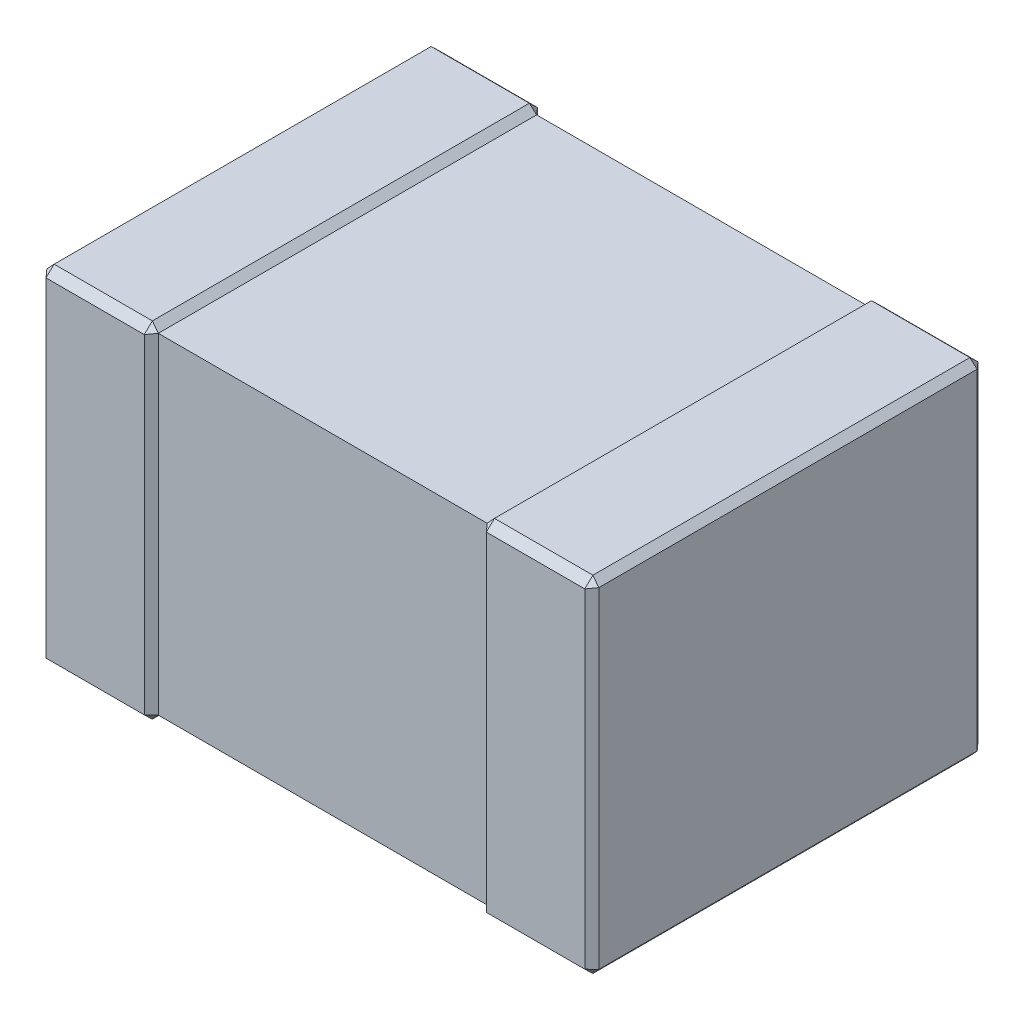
ISO-10303-21;
HEADER;
FILE_DESCRIPTION(('STEP AP214'),'2;1');
FILE_NAME('part.step','',(''),(''),'','','');
FILE_SCHEMA(('AUTOMOTIVE_DESIGN { 1 0 10303 214 1 1 1 1 }'));
ENDSEC;
DATA;
#1=APPLICATION_CONTEXT('core data for automotive mechanical design processes');
#2=APPLICATION_PROTOCOL_DEFINITION('international standard','automotive_design',2000,#1);
#3=PRODUCT_CONTEXT('',#1,'mechanical');
#4=PRODUCT('Part','Part','',(#3));
#5=PRODUCT_RELATED_PRODUCT_CATEGORY('part','',(#4));
#6=PRODUCT_DEFINITION_FORMATION('','',#4);
#7=PRODUCT_DEFINITION_CONTEXT('part definition',#1,'design');
#8=PRODUCT_DEFINITION('design','',#6,#7);
#9=PRODUCT_DEFINITION_SHAPE('','',#8);
#10=(LENGTH_UNIT() NAMED_UNIT(*) SI_UNIT(.MILLI.,.METRE.));
#11=(NAMED_UNIT(*) PLANE_ANGLE_UNIT() SI_UNIT($,.RADIAN.));
#12=(NAMED_UNIT(*) SI_UNIT($,.STERADIAN.) SOLID_ANGLE_UNIT());
#13=UNCERTAINTY_MEASURE_WITH_UNIT(LENGTH_MEASURE(1.E-05),#10,'distance_accuracy_value','');
#14=(GEOMETRIC_REPRESENTATION_CONTEXT(3) GLOBAL_UNCERTAINTY_ASSIGNED_CONTEXT((#13)) GLOBAL_UNIT_ASSIGNED_CONTEXT((#10,
#11,#12)) REPRESENTATION_CONTEXT('',''));
#15=CARTESIAN_POINT('',(0.,0.,0.));
#16=DIRECTION('',(0.,0.,1.));
#17=DIRECTION('',(1.,0.,0.));
#18=AXIS2_PLACEMENT_3D('',#15,#16,#17);
#19=CARTESIAN_POINT('',(-1.001803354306,0.632319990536,0.756342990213));
#20=DIRECTION('',(-0.642674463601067,0.76613936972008,0.));
#21=DIRECTION('',(-0.76613936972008,-0.642674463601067,0.));
#22=AXIS2_PLACEMENT_3D('',#19,#20,#21);
#23=PLANE('',#22);
#24=DIRECTION('',(0.,0.,-1.));
#25=VECTOR('',#24,1.);
#26=CARTESIAN_POINT('',(-0.995628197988,0.637500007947,1.44267876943));
#27=LINE('',#26,#25);
#28=CARTESIAN_POINT('',(-0.995628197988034,0.637500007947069,1.44267876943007));
#29=VERTEX_POINT('',#28);
#30=CARTESIAN_POINT('',(-0.995628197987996,0.637500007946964,0.0493022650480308));
#31=VERTEX_POINT('',#30);
#32=EDGE_CURVE('E190',#29,#31,#27,.T.);
#33=ORIENTED_EDGE('',*,*,#32,.T.);
#34=DIRECTION('',(0.738304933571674,0.619325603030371,0.267098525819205));
#35=VECTOR('',#34,1.);
#36=CARTESIAN_POINT('',(-1.019966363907,0.6170839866,0.0404973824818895));
#37=LINE('',#36,#35);
#38=CARTESIAN_POINT('',(-1.01996636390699,0.611051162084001,0.0467786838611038));
#39=VERTEX_POINT('',#38);
#40=EDGE_CURVE('E178',#39,#31,#37,.T.);
#41=ORIENTED_EDGE('',*,*,#40,.F.);
#42=CARTESIAN_POINT('',(-1.01996636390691,0.617083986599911,0.0404973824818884));
#43=DIRECTION('',(0.,0.,1.));
#44=VECTOR('',#43,1.);
#45=LINE('',#42,#44);
#46=CARTESIAN_POINT('',(-1.01996636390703,0.611051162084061,1.44520227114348));
#47=VERTEX_POINT('',#46);
#48=EDGE_CURVE('E187',#39,#47,#45,.T.);
#49=ORIENTED_EDGE('',*,*,#48,.T.);
#50=DIRECTION('',(0.738305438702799,0.619326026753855,-0.26709614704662));
#51=VECTOR('',#50,1.);
#52=CARTESIAN_POINT('',(-1.01996636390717,0.617083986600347,1.45148356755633));
#53=LINE('',#52,#51);
#54=EDGE_CURVE('E192',#47,#29,#53,.T.);
#55=ORIENTED_EDGE('',*,*,#54,.T.);
#56=EDGE_LOOP('',(#33,#41,#49,#55));
#57=FACE_BOUND('',#56,.T.);
#58=ADVANCED_FACE('F17',(#57),#23,.T.);
#59=CARTESIAN_POINT('',(-1.003102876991,0.621198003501,1.455827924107));
#60=DIRECTION('',(0.334045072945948,-0.679797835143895,-0.652907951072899));
#61=DIRECTION('',(0.,0.692698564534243,-0.721227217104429));
#62=AXIS2_PLACEMENT_3D('',#59,#60,#61);
#63=PLANE('',#62);
#64=DIRECTION('',(0.,0.692698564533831,-0.721227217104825));
#65=VECTOR('',#64,1.);
#66=CARTESIAN_POINT('',(-0.995628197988,0.637500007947,1.44267876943));
#67=LINE('',#66,#65);
#68=CARTESIAN_POINT('',(-0.995628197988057,0.608627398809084,1.47274049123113));
#69=VERTEX_POINT('',#68);
#70=EDGE_CURVE('E1022',#69,#29,#67,.T.);
#71=ORIENTED_EDGE('',*,*,#70,.T.);
#72=ORIENTED_EDGE('',*,*,#54,.F.);
#73=DIRECTION('',(-0.728636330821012,0.25317343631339,-0.636390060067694));
#74=VECTOR('',#73,1.);
#75=CARTESIAN_POINT('',(-0.995628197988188,0.608627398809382,1.47274049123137));
#76=LINE('',#75,#74);
#77=EDGE_CURVE('E927',#69,#47,#76,.T.);
#78=ORIENTED_EDGE('',*,*,#77,.F.);
#79=EDGE_LOOP('',(#71,#72,#78));
#80=FACE_BOUND('',#79,.T.);
#81=ADVANCED_FACE('F1124',(#80),#63,.F.);
#82=CARTESIAN_POINT('',(1.020033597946,0.6170839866,1.451483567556));
#83=DIRECTION('',(-0.642675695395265,-0.766138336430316,0.));
#84=DIRECTION('',(0.766138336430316,-0.642675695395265,0.));
#85=AXIS2_PLACEMENT_3D('',#82,#83,#84);
#86=PLANE('',#85);
#87=DIRECTION('',(0.,0.,-1.));
#88=VECTOR('',#87,1.);
#89=CARTESIAN_POINT('',(0.9956955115,0.637500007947,0.04930226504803));
#90=LINE('',#89,#88);
#91=CARTESIAN_POINT('',(0.995695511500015,0.637500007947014,0.0493022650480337));
#92=VERTEX_POINT('',#91);
#93=CARTESIAN_POINT('',(0.995695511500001,0.637500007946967,1.44267876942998));
#94=VERTEX_POINT('',#93);
#95=EDGE_CURVE('E212',#92,#94,#90,.F.);
#96=ORIENTED_EDGE('',*,*,#95,.T.);
#97=DIRECTION('',(0.738304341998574,-0.619327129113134,0.267096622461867));
#98=VECTOR('',#97,1.);
#99=CARTESIAN_POINT('',(0.995695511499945,0.637500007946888,1.44267876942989));
#100=LINE('',#99,#98);
#101=CARTESIAN_POINT('',(1.02003359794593,0.611051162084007,1.44520227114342));
#102=VERTEX_POINT('',#101);
#103=EDGE_CURVE('E922',#94,#102,#100,.T.);
#104=ORIENTED_EDGE('',*,*,#103,.T.);
#105=CARTESIAN_POINT('',(1.020033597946,0.6170839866,1.451483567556));
#106=DIRECTION('',(0.,0.,-1.));
#107=VECTOR('',#106,1.);
#108=LINE('',#105,#107);
#109=CARTESIAN_POINT('',(1.02003359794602,0.611051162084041,0.0467786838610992));
#110=VERTEX_POINT('',#109);
#111=EDGE_CURVE('E227',#102,#110,#108,.T.);
#112=ORIENTED_EDGE('',*,*,#111,.T.);
#113=DIRECTION('',(0.738303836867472,-0.619326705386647,-0.267099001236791));
#114=VECTOR('',#113,1.);
#115=CARTESIAN_POINT('',(0.995695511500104,0.637500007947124,0.0493022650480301));
#116=LINE('',#115,#114);
#117=EDGE_CURVE('E923',#92,#110,#116,.T.);
#118=ORIENTED_EDGE('',*,*,#117,.F.);
#119=EDGE_LOOP('',(#96,#104,#112,#118));
#120=FACE_BOUND('',#119,.T.);
#121=ADVANCED_FACE('F920',(#120),#86,.F.);
#122=CARTESIAN_POINT('',(-1.019966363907,0.6170839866,0.04049738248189));
#123=DIRECTION('',(0.334043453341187,-0.679798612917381,0.652907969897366));
#124=DIRECTION('',(0.,-0.692698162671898,-0.721227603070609));
#125=AXIS2_PLACEMENT_3D('',#122,#123,#124);
#126=PLANE('',#125);
#127=DIRECTION('',(0.,-0.692698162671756,-0.721227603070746));
#128=VECTOR('',#127,1.);
#129=CARTESIAN_POINT('',(-0.995628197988,0.629868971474,0.04135693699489));
#130=LINE('',#129,#128);
#131=CARTESIAN_POINT('',(-0.995628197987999,0.608627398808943,0.0192405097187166));
#132=VERTEX_POINT('',#131);
#133=EDGE_CURVE('E182',#31,#132,#130,.T.);
#134=ORIENTED_EDGE('',*,*,#133,.T.);
#135=DIRECTION('',(0.728637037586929,-0.253173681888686,-0.636389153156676));
#136=VECTOR('',#135,1.);
#137=CARTESIAN_POINT('',(-1.01996636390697,0.6170839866,0.0404973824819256));
#138=LINE('',#137,#136);
#139=EDGE_CURVE('E184',#39,#132,#138,.T.);
#140=ORIENTED_EDGE('',*,*,#139,.F.);
#141=ORIENTED_EDGE('',*,*,#40,.T.);
#142=EDGE_LOOP('',(#134,#140,#141));
#143=FACE_BOUND('',#142,.T.);
#144=ADVANCED_FACE('F180',(#143),#126,.F.);
#145=CARTESIAN_POINT('',(-1.019966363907,-0.605018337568,1.438920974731));
#146=DIRECTION('',(1.,0.,0.));
#147=DIRECTION('',(0.,0.,-1.));
#148=AXIS2_PLACEMENT_3D('',#145,#146,#147);
#149=PLANE('',#148);
#150=CARTESIAN_POINT('',(-1.019966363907,-0.617083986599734,0.0404973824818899));
#151=DIRECTION('',(0.,1.,0.));
#152=VECTOR('',#151,1.);
#153=LINE('',#150,#152);
#154=CARTESIAN_POINT('',(-1.01996636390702,-0.611051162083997,0.0467786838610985));
#155=VERTEX_POINT('',#154);
#156=EDGE_CURVE('E196',#155,#39,#153,.T.);
#157=ORIENTED_EDGE('',*,*,#156,.F.);
#158=CARTESIAN_POINT('',(-1.01996636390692,-0.617083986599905,1.45148356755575));
#159=DIRECTION('',(0.,0.,-1.));
#160=VECTOR('',#159,1.);
#161=LINE('',#158,#160);
#162=CARTESIAN_POINT('',(-1.01996636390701,-0.611051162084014,1.44520227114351));
#163=VERTEX_POINT('',#162);
#164=EDGE_CURVE('E206',#163,#155,#161,.T.);
#165=ORIENTED_EDGE('',*,*,#164,.F.);
#166=CARTESIAN_POINT('',(-1.019966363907,-0.605018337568,1.438920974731));
#167=DIRECTION('',(0.,1.,0.));
#168=VECTOR('',#167,1.);
#169=LINE('',#166,#168);
#170=EDGE_CURVE('E294',#163,#47,#169,.T.);
#171=ORIENTED_EDGE('',*,*,#170,.T.);
#172=ORIENTED_EDGE('',*,*,#48,.F.);
#173=EDGE_LOOP('',(#157,#165,#171,#172));
#174=FACE_BOUND('',#173,.T.);
#175=ADVANCED_FACE('F313',(#174),#149,.F.);
#176=CARTESIAN_POINT('',(1.020033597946,0.6170839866,1.451483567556));
#177=DIRECTION('',(-0.334046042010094,-0.679797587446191,-0.652907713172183));
#178=DIRECTION('',(0.,0.692698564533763,-0.72122721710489));
#179=AXIS2_PLACEMENT_3D('',#176,#177,#178);
#180=PLANE('',#179);
#181=DIRECTION('',(0.,0.692698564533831,-0.721227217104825));
#182=VECTOR('',#181,1.);
#183=CARTESIAN_POINT('',(0.9956955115,0.637500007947,1.44267876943));
#184=LINE('',#183,#182);
#185=CARTESIAN_POINT('',(0.99569551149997,0.608627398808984,1.47274049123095));
#186=VERTEX_POINT('',#185);
#187=EDGE_CURVE('E641',#94,#186,#184,.F.);
#188=ORIENTED_EDGE('',*,*,#187,.T.);
#189=DIRECTION('',(0.728635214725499,0.253173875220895,-0.636391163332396));
#190=VECTOR('',#189,1.);
#191=CARTESIAN_POINT('',(0.995695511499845,0.608627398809,1.47274049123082));
#192=LINE('',#191,#190);
#193=EDGE_CURVE('E636',#186,#102,#192,.T.);
#194=ORIENTED_EDGE('',*,*,#193,.T.);
#195=ORIENTED_EDGE('',*,*,#103,.F.);
#196=EDGE_LOOP('',(#188,#194,#195));
#197=FACE_BOUND('',#196,.T.);
#198=ADVANCED_FACE('F322',(#197),#180,.F.);
#199=CARTESIAN_POINT('',(-1.019966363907,-0.6170839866,1.451483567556));
#200=DIRECTION('',(0.657821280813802,0.,-0.753174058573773));
#201=DIRECTION('',(-0.753174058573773,0.,-0.657821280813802));
#202=AXIS2_PLACEMENT_3D('',#199,#200,#201);
#203=PLANE('',#202);
#204=DIRECTION('',(0.,1.,0.));
#205=VECTOR('',#204,1.);
#206=CARTESIAN_POINT('',(-0.995628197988,0.608627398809,1.472740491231));
#207=LINE('',#206,#205);
#208=CARTESIAN_POINT('',(-0.995628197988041,-0.608627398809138,1.47274049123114));
#209=VERTEX_POINT('',#208);
#210=EDGE_CURVE('E631',#209,#69,#207,.T.);
#211=ORIENTED_EDGE('',*,*,#210,.T.);
#212=ORIENTED_EDGE('',*,*,#77,.T.);
#213=ORIENTED_EDGE('',*,*,#170,.F.);
#214=DIRECTION('',(0.728636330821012,0.25317343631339,0.636390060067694));
#215=VECTOR('',#214,1.);
#216=CARTESIAN_POINT('',(-1.01996636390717,-0.617083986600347,1.45148356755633));
#217=LINE('',#216,#215);
#218=EDGE_CURVE('E646',#163,#209,#217,.T.);
#219=ORIENTED_EDGE('',*,*,#218,.T.);
#220=EDGE_LOOP('',(#211,#212,#213,#219));
#221=FACE_BOUND('',#220,.T.);
#222=ADVANCED_FACE('F254',(#221),#203,.F.);
#223=CARTESIAN_POINT('',(1.020033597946,0.605018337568,1.438920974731));
#224=DIRECTION('',(-1.,0.,0.));
#225=DIRECTION('',(0.,0.,1.));
#226=AXIS2_PLACEMENT_3D('',#223,#224,#225);
#227=PLANE('',#226);
#228=CARTESIAN_POINT('',(1.020033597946,0.617083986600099,0.0404973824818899));
#229=DIRECTION('',(0.,-1.,0.));
#230=VECTOR('',#229,1.);
#231=LINE('',#228,#230);
#232=CARTESIAN_POINT('',(1.02003359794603,-0.611051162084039,0.0467786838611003));
#233=VERTEX_POINT('',#232);
#234=EDGE_CURVE('E237',#110,#233,#231,.T.);
#235=ORIENTED_EDGE('',*,*,#234,.F.);
#236=ORIENTED_EDGE('',*,*,#111,.F.);
#237=CARTESIAN_POINT('',(1.020033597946,0.605018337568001,1.438920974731));
#238=DIRECTION('',(0.,-1.,0.));
#239=VECTOR('',#238,1.);
#240=LINE('',#237,#239);
#241=CARTESIAN_POINT('',(1.02003359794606,-0.611051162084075,1.4452022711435));
#242=VERTEX_POINT('',#241);
#243=EDGE_CURVE('E279',#102,#242,#240,.T.);
#244=ORIENTED_EDGE('',*,*,#243,.T.);
#245=CARTESIAN_POINT('',(1.02003359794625,-0.617083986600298,0.04049738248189));
#246=DIRECTION('',(0.,0.,1.));
#247=VECTOR('',#246,1.);
#248=LINE('',#245,#247);
#249=EDGE_CURVE('E197',#233,#242,#248,.T.);
#250=ORIENTED_EDGE('',*,*,#249,.F.);
#251=EDGE_LOOP('',(#235,#236,#244,#250));
#252=FACE_BOUND('',#251,.T.);
#253=ADVANCED_FACE('F244',(#252),#227,.F.);
#254=CARTESIAN_POINT('',(-0.632477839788,0.637500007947,1.44267876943));
#255=DIRECTION('',(0.,-1.,0.));
#256=DIRECTION('',(0.,0.,-1.));
#257=AXIS2_PLACEMENT_3D('',#254,#255,#256);
#258=PLANE('',#257);
#259=DIRECTION('',(1.,0.,0.));
#260=VECTOR('',#259,1.);
#261=CARTESIAN_POINT('',(-0.823877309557,0.637500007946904,0.049302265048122));
#262=LINE('',#261,#260);
#263=CARTESIAN_POINT('',(-0.632477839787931,0.637500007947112,0.0493022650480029));
#264=VERTEX_POINT('',#263);
#265=EDGE_CURVE('E203',#264,#31,#262,.F.);
#266=ORIENTED_EDGE('',*,*,#265,.T.);
#267=ORIENTED_EDGE('',*,*,#32,.F.);
#268=DIRECTION('',(1.,0.,0.));
#269=VECTOR('',#268,1.);
#270=CARTESIAN_POINT('',(-0.632477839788,0.637500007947,1.44267876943));
#271=LINE('',#270,#269);
#272=CARTESIAN_POINT('',(-0.632477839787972,0.637500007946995,1.44267876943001));
#273=VERTEX_POINT('',#272);
#274=EDGE_CURVE('E242',#29,#273,#271,.T.);
#275=ORIENTED_EDGE('',*,*,#274,.T.);
#276=DIRECTION('',(0.,0.,1.));
#277=VECTOR('',#276,1.);
#278=CARTESIAN_POINT('',(-0.632477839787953,0.637500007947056,0.756342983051));
#279=LINE('',#278,#277);
#280=EDGE_CURVE('E210',#264,#273,#279,.T.);
#281=ORIENTED_EDGE('',*,*,#280,.F.);
#282=EDGE_LOOP('',(#266,#267,#275,#281));
#283=FACE_BOUND('',#282,.T.);
#284=ADVANCED_FACE('F208',(#283),#258,.F.);
#285=CARTESIAN_POINT('',(1.00317015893,0.621198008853,0.03615307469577));
#286=DIRECTION('',(0.334044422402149,0.679798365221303,-0.652907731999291));
#287=DIRECTION('',(0.,0.692698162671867,0.721227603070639));
#288=AXIS2_PLACEMENT_3D('',#285,#286,#287);
#289=PLANE('',#288);
#290=DIRECTION('',(0.,0.692698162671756,0.721227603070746));
#291=VECTOR('',#290,1.);
#292=CARTESIAN_POINT('',(0.9956955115,0.62986968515,0.04135768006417));
#293=LINE('',#292,#291);
#294=CARTESIAN_POINT('',(0.995695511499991,0.60862739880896,0.0192405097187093));
#295=VERTEX_POINT('',#294);
#296=EDGE_CURVE('E607',#92,#295,#293,.F.);
#297=ORIENTED_EDGE('',*,*,#296,.F.);
#298=ORIENTED_EDGE('',*,*,#117,.T.);
#299=DIRECTION('',(-0.728635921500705,-0.253174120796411,-0.636390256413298));
#300=VECTOR('',#299,1.);
#301=CARTESIAN_POINT('',(1.020033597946,0.6170839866,0.04049738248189));
#302=LINE('',#301,#300);
#303=EDGE_CURVE('E611',#110,#295,#302,.T.);
#304=ORIENTED_EDGE('',*,*,#303,.T.);
#305=EDGE_LOOP('',(#297,#298,#304));
#306=FACE_BOUND('',#305,.T.);
#307=ADVANCED_FACE('F928',(#306),#289,.T.);
#308=CARTESIAN_POINT('',(-1.003102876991,-0.621198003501,1.455827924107));
#309=DIRECTION('',(0.334045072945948,0.679797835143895,-0.652907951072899));
#310=DIRECTION('',(0.,0.692698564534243,0.721227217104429));
#311=AXIS2_PLACEMENT_3D('',#308,#309,#310);
#312=PLANE('',#311);
#313=DIRECTION('',(0.,-0.692698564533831,-0.721227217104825));
#314=VECTOR('',#313,1.);
#315=CARTESIAN_POINT('',(-0.995628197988,-0.616258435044,1.464795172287));
#316=LINE('',#315,#314);
#317=CARTESIAN_POINT('',(-0.995628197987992,-0.637500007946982,1.44267876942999));
#318=VERTEX_POINT('',#317);
#319=EDGE_CURVE('E593',#209,#318,#316,.T.);
#320=ORIENTED_EDGE('',*,*,#319,.F.);
#321=ORIENTED_EDGE('',*,*,#218,.F.);
#322=DIRECTION('',(-0.738305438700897,0.619326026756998,0.267096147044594));
#323=VECTOR('',#322,1.);
#324=CARTESIAN_POINT('',(-0.995628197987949,-0.637500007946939,1.44267876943));
#325=LINE('',#324,#323);
#326=EDGE_CURVE('E602',#318,#163,#325,.T.);
#327=ORIENTED_EDGE('',*,*,#326,.F.);
#328=EDGE_LOOP('',(#320,#321,#327));
#329=FACE_BOUND('',#328,.T.);
#330=ADVANCED_FACE('F1012',(#329),#312,.F.);
#331=CARTESIAN_POINT('',(-1.019966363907,-0.6170839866,0.04049738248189));
#332=DIRECTION('',(0.657820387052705,0.,0.753174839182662));
#333=DIRECTION('',(0.753174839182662,0.,-0.657820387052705));
#334=AXIS2_PLACEMENT_3D('',#331,#332,#333);
#335=PLANE('',#334);
#336=DIRECTION('',(0.,1.,0.));
#337=VECTOR('',#336,1.);
#338=CARTESIAN_POINT('',(-0.995628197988,-0.608627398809,0.01924050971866));
#339=LINE('',#338,#337);
#340=CARTESIAN_POINT('',(-0.995628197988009,-0.608627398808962,0.0192405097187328));
#341=VERTEX_POINT('',#340);
#342=EDGE_CURVE('E576',#132,#341,#339,.F.);
#343=ORIENTED_EDGE('',*,*,#342,.T.);
#344=DIRECTION('',(-0.72863703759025,-0.253173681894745,0.636389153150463));
#345=VECTOR('',#344,1.);
#346=CARTESIAN_POINT('',(-0.9956281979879,-0.608627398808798,0.0192405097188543));
#347=LINE('',#346,#345);
#348=EDGE_CURVE('E584',#341,#155,#347,.T.);
#349=ORIENTED_EDGE('',*,*,#348,.T.);
#350=ORIENTED_EDGE('',*,*,#156,.T.);
#351=ORIENTED_EDGE('',*,*,#139,.T.);
#352=EDGE_LOOP('',(#343,#349,#350,#351));
#353=FACE_BOUND('',#352,.T.);
#354=ADVANCED_FACE('F662',(#353),#335,.F.);
#355=CARTESIAN_POINT('',(1.001883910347,0.0103582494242,1.467335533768));
#356=DIRECTION('',(-0.657822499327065,0.,-0.753172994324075));
#357=DIRECTION('',(-0.753172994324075,0.,0.657822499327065));
#358=AXIS2_PLACEMENT_3D('',#355,#356,#357);
#359=PLANE('',#358);
#360=DIRECTION('',(0.,1.,0.));
#361=VECTOR('',#360,1.);
#362=CARTESIAN_POINT('',(0.9956955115,0.608627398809,1.472740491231));
#363=LINE('',#362,#361);
#364=CARTESIAN_POINT('',(0.995695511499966,-0.608627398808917,1.47274049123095));
#365=VERTEX_POINT('',#364);
#366=EDGE_CURVE('E570',#186,#365,#363,.F.);
#367=ORIENTED_EDGE('',*,*,#366,.T.);
#368=DIRECTION('',(0.72863521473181,-0.253173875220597,-0.636391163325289));
#369=VECTOR('',#368,1.);
#370=CARTESIAN_POINT('',(0.995695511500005,-0.60862739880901,1.47274049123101));
#371=LINE('',#370,#369);
#372=EDGE_CURVE('E625',#365,#242,#371,.T.);
#373=ORIENTED_EDGE('',*,*,#372,.T.);
#374=ORIENTED_EDGE('',*,*,#243,.F.);
#375=ORIENTED_EDGE('',*,*,#193,.F.);
#376=EDGE_LOOP('',(#367,#373,#374,#375));
#377=FACE_BOUND('',#376,.T.);
#378=ADVANCED_FACE('F1065',(#377),#359,.F.);
#379=CARTESIAN_POINT('',(-0.804228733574,0.616258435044,1.464795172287));
#380=DIRECTION('',(0.,0.721227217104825,0.692698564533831));
#381=DIRECTION('',(0.,-0.692698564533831,0.721227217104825));
#382=AXIS2_PLACEMENT_3D('',#379,#380,#381);
#383=PLANE('',#382);
#384=DIRECTION('',(-1.,0.,0.));
#385=VECTOR('',#384,1.);
#386=CARTESIAN_POINT('',(-0.995628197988,0.608627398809,1.472740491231));
#387=LINE('',#386,#385);
#388=CARTESIAN_POINT('',(-0.632477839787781,0.608627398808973,1.47274049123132));
#389=VERTEX_POINT('',#388);
#390=EDGE_CURVE('E565',#69,#389,#387,.F.);
#391=ORIENTED_EDGE('',*,*,#390,.T.);
#392=DIRECTION('',(0.,0.692698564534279,-0.721227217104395));
#393=VECTOR('',#392,1.);
#394=CARTESIAN_POINT('',(-0.632477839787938,0.623304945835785,1.45745845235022));
#395=LINE('',#394,#393);
#396=EDGE_CURVE('E560',#389,#273,#395,.T.);
#397=ORIENTED_EDGE('',*,*,#396,.T.);
#398=ORIENTED_EDGE('',*,*,#274,.F.);
#399=ORIENTED_EDGE('',*,*,#70,.F.);
#400=EDGE_LOOP('',(#391,#397,#398,#399));
#401=FACE_BOUND('',#400,.T.);
#402=ADVANCED_FACE('F1020',(#401),#383,.T.);
#403=CARTESIAN_POINT('',(1.020033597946,-0.6170839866,1.451483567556));
#404=DIRECTION('',(-0.334046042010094,0.679797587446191,-0.652907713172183));
#405=DIRECTION('',(0.,0.692698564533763,0.72122721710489));
#406=AXIS2_PLACEMENT_3D('',#403,#404,#405);
#407=PLANE('',#406);
#408=DIRECTION('',(0.,0.692698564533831,0.721227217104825));
#409=VECTOR('',#408,1.);
#410=CARTESIAN_POINT('',(0.9956955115,-0.616257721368,1.464795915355));
#411=LINE('',#410,#409);
#412=CARTESIAN_POINT('',(0.995695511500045,-0.637500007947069,1.44267876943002));
#413=VERTEX_POINT('',#412);
#414=EDGE_CURVE('E546',#365,#413,#411,.F.);
#415=ORIENTED_EDGE('',*,*,#414,.T.);
#416=DIRECTION('',(0.73830434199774,0.619327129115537,0.267096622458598));
#417=VECTOR('',#416,1.);
#418=CARTESIAN_POINT('',(0.995695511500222,-0.637500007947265,1.44267876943));
#419=LINE('',#418,#417);
#420=EDGE_CURVE('E551',#413,#242,#419,.T.);
#421=ORIENTED_EDGE('',*,*,#420,.T.);
#422=ORIENTED_EDGE('',*,*,#372,.F.);
#423=EDGE_LOOP('',(#415,#421,#422));
#424=FACE_BOUND('',#423,.T.);
#425=ADVANCED_FACE('F1211',(#424),#407,.F.);
#426=CARTESIAN_POINT('',(0.631912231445,0.637500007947,0.04930226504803));
#427=DIRECTION('',(0.,-1.,0.));
#428=DIRECTION('',(0.,0.,-1.));
#429=AXIS2_PLACEMENT_3D('',#426,#427,#428);
#430=PLANE('',#429);
#431=DIRECTION('',(1.,0.,0.));
#432=VECTOR('',#431,1.);
#433=CARTESIAN_POINT('',(0.631912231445,0.637500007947,1.44267876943));
#434=LINE('',#433,#432);
#435=CARTESIAN_POINT('',(0.631912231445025,0.637500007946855,1.44267876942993));
#436=VERTEX_POINT('',#435);
#437=EDGE_CURVE('E616',#94,#436,#434,.F.);
#438=ORIENTED_EDGE('',*,*,#437,.F.);
#439=ORIENTED_EDGE('',*,*,#95,.F.);
#440=DIRECTION('',(1.,0.,0.));
#441=VECTOR('',#440,1.);
#442=CARTESIAN_POINT('',(0.631912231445,0.637500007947,0.04930226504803));
#443=LINE('',#442,#441);
#444=CARTESIAN_POINT('',(0.631912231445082,0.637500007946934,0.0493022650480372));
#445=VERTEX_POINT('',#444);
#446=EDGE_CURVE('E215',#445,#92,#443,.T.);
#447=ORIENTED_EDGE('',*,*,#446,.F.);
#448=DIRECTION('',(0.,0.,1.));
#449=VECTOR('',#448,1.);
#450=CARTESIAN_POINT('',(0.631912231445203,0.637500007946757,1.451483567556));
#451=LINE('',#450,#449);
#452=EDGE_CURVE('E545',#445,#436,#451,.T.);
#453=ORIENTED_EDGE('',*,*,#452,.T.);
#454=EDGE_LOOP('',(#438,#439,#447,#453));
#455=FACE_BOUND('',#454,.T.);
#456=ADVANCED_FACE('F707',(#455),#430,.F.);
#457=CARTESIAN_POINT('',(-0.995628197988,0.608627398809,0.01924050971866));
#458=DIRECTION('',(0.,-0.721227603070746,0.692698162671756));
#459=DIRECTION('',(0.,-0.692698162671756,-0.721227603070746));
#460=AXIS2_PLACEMENT_3D('',#457,#458,#459);
#461=PLANE('',#460);
#462=DIRECTION('',(0.,-0.692698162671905,-0.721227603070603));
#463=VECTOR('',#462,1.);
#464=CARTESIAN_POINT('',(-0.63247783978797,0.623108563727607,0.0343180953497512));
#465=LINE('',#464,#463);
#466=CARTESIAN_POINT('',(-0.632477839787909,0.608627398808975,0.0192405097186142));
#467=VERTEX_POINT('',#466);
#468=EDGE_CURVE('E691',#264,#467,#465,.T.);
#469=ORIENTED_EDGE('',*,*,#468,.T.);
#470=DIRECTION('',(1.,0.,0.));
#471=VECTOR('',#470,1.);
#472=CARTESIAN_POINT('',(-0.995628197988,0.608627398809,0.01924050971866));
#473=LINE('',#472,#471);
#474=EDGE_CURVE('E205',#467,#132,#473,.F.);
#475=ORIENTED_EDGE('',*,*,#474,.T.);
#476=ORIENTED_EDGE('',*,*,#133,.F.);
#477=ORIENTED_EDGE('',*,*,#265,.F.);
#478=EDGE_LOOP('',(#469,#475,#476,#477));
#479=FACE_BOUND('',#478,.T.);
#480=ADVANCED_FACE('F202',(#479),#461,.F.);
#481=CARTESIAN_POINT('',(1.020033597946,0.6170839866,0.04049738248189));
#482=DIRECTION('',(-0.657821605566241,0.,0.753173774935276));
#483=DIRECTION('',(0.753173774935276,0.,0.657821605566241));
#484=AXIS2_PLACEMENT_3D('',#481,#482,#483);
#485=PLANE('',#484);
#486=DIRECTION('',(0.,1.,0.));
#487=VECTOR('',#486,1.);
#488=CARTESIAN_POINT('',(0.9956955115,-0.608627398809,0.01924050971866));
#489=LINE('',#488,#487);
#490=CARTESIAN_POINT('',(0.995695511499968,-0.608627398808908,0.0192405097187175));
#491=VERTEX_POINT('',#490);
#492=EDGE_CURVE('E677',#491,#295,#489,.T.);
#493=ORIENTED_EDGE('',*,*,#492,.T.);
#494=ORIENTED_EDGE('',*,*,#303,.F.);
#495=ORIENTED_EDGE('',*,*,#234,.T.);
#496=DIRECTION('',(-0.72863592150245,0.253174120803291,-0.636390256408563));
#497=VECTOR('',#496,1.);
#498=CARTESIAN_POINT('',(1.020033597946,-0.6170839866,0.04049738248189));
#499=LINE('',#498,#497);
#500=EDGE_CURVE('E537',#233,#491,#499,.T.);
#501=ORIENTED_EDGE('',*,*,#500,.T.);
#502=EDGE_LOOP('',(#493,#494,#495,#501));
#503=FACE_BOUND('',#502,.T.);
#504=ADVANCED_FACE('F930',(#503),#485,.F.);
#505=CARTESIAN_POINT('',(-1.001803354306,-0.632319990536,0.756342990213));
#506=DIRECTION('',(-0.642674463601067,-0.76613936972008,0.));
#507=DIRECTION('',(0.76613936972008,-0.642674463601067,0.));
#508=AXIS2_PLACEMENT_3D('',#505,#506,#507);
#509=PLANE('',#508);
#510=DIRECTION('',(0.,0.,1.));
#511=VECTOR('',#510,1.);
#512=CARTESIAN_POINT('',(-0.995628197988,-0.637500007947,1.44267876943));
#513=LINE('',#512,#511);
#514=CARTESIAN_POINT('',(-0.995628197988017,-0.637500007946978,0.0493022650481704));
#515=VERTEX_POINT('',#514);
#516=EDGE_CURVE('E673',#515,#318,#513,.T.);
#517=ORIENTED_EDGE('',*,*,#516,.T.);
#518=ORIENTED_EDGE('',*,*,#326,.T.);
#519=ORIENTED_EDGE('',*,*,#164,.T.);
#520=DIRECTION('',(0.738304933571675,-0.619325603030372,0.267098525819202));
#521=VECTOR('',#520,1.);
#522=CARTESIAN_POINT('',(-1.0199663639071,-0.617083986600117,0.0404973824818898));
#523=LINE('',#522,#521);
#524=EDGE_CURVE('E650',#155,#515,#523,.T.);
#525=ORIENTED_EDGE('',*,*,#524,.T.);
#526=EDGE_LOOP('',(#517,#518,#519,#525));
#527=FACE_BOUND('',#526,.T.);
#528=ADVANCED_FACE('F658',(#527),#509,.T.);
#529=CARTESIAN_POINT('',(-1.019966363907,-0.6170839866,0.04049738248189));
#530=DIRECTION('',(0.334043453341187,0.679798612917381,0.652907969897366));
#531=DIRECTION('',(0.,-0.692698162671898,0.721227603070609));
#532=AXIS2_PLACEMENT_3D('',#529,#530,#531);
#533=PLANE('',#532);
#534=DIRECTION('',(0.,-0.692698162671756,0.721227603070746));
#535=VECTOR('',#534,1.);
#536=CARTESIAN_POINT('',(-0.995628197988,-0.629868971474,0.04135693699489));
#537=LINE('',#536,#535);
#538=EDGE_CURVE('E669',#341,#515,#537,.T.);
#539=ORIENTED_EDGE('',*,*,#538,.T.);
#540=ORIENTED_EDGE('',*,*,#524,.F.);
#541=ORIENTED_EDGE('',*,*,#348,.F.);
#542=EDGE_LOOP('',(#539,#540,#541));
#543=FACE_BOUND('',#542,.T.);
#544=ADVANCED_FACE('F668',(#543),#533,.F.);
#545=CARTESIAN_POINT('',(0.803978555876,0.616257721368,1.464795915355));
#546=DIRECTION('',(0.,0.721227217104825,0.692698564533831));
#547=DIRECTION('',(0.,-0.692698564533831,0.721227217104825));
#548=AXIS2_PLACEMENT_3D('',#545,#546,#547);
#549=PLANE('',#548);
#550=DIRECTION('',(-1.,0.,0.));
#551=VECTOR('',#550,1.);
#552=CARTESIAN_POINT('',(0.631912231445,0.608627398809,1.472740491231));
#553=LINE('',#552,#551);
#554=CARTESIAN_POINT('',(0.631912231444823,0.608627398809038,1.4727404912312));
#555=VERTEX_POINT('',#554);
#556=EDGE_CURVE('E573',#555,#186,#553,.F.);
#557=ORIENTED_EDGE('',*,*,#556,.T.);
#558=ORIENTED_EDGE('',*,*,#187,.F.);
#559=ORIENTED_EDGE('',*,*,#437,.T.);
#560=DIRECTION('',(0.,-0.692698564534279,0.721227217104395));
#561=VECTOR('',#560,1.);
#562=CARTESIAN_POINT('',(0.631912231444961,0.623108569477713,1.45766291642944));
#563=LINE('',#562,#561);
#564=EDGE_CURVE('E675',#555,#436,#563,.F.);
#565=ORIENTED_EDGE('',*,*,#564,.F.);
#566=EDGE_LOOP('',(#557,#558,#559,#565));
#567=FACE_BOUND('',#566,.T.);
#568=ADVANCED_FACE('F914',(#567),#549,.T.);
#569=CARTESIAN_POINT('',(-0.995628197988,0.608627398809,1.472740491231));
#570=DIRECTION('',(0.,0.,-1.));
#571=DIRECTION('',(-1.,0.,0.));
#572=AXIS2_PLACEMENT_3D('',#569,#570,#571);
#573=PLANE('',#572);
#574=DIRECTION('',(0.,1.,0.));
#575=VECTOR('',#574,1.);
#576=CARTESIAN_POINT('',(-0.632477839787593,0.01035825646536,1.47274049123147));
#577=LINE('',#576,#575);
#578=CARTESIAN_POINT('',(-0.632477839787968,-0.608627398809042,1.47274049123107));
#579=VERTEX_POINT('',#578);
#580=EDGE_CURVE('E715',#579,#389,#577,.T.);
#581=ORIENTED_EDGE('',*,*,#580,.T.);
#582=ORIENTED_EDGE('',*,*,#390,.F.);
#583=ORIENTED_EDGE('',*,*,#210,.F.);
#584=DIRECTION('',(1.,0.,0.));
#585=VECTOR('',#584,1.);
#586=CARTESIAN_POINT('',(-0.823877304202,-0.608627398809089,1.47274049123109));
#587=LINE('',#586,#585);
#588=EDGE_CURVE('E597',#579,#209,#587,.F.);
#589=ORIENTED_EDGE('',*,*,#588,.F.);
#590=EDGE_LOOP('',(#581,#582,#583,#589));
#591=FACE_BOUND('',#590,.T.);
#592=ADVANCED_FACE('F1015',(#591),#573,.F.);
#593=CARTESIAN_POINT('',(-0.608139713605,0.6170839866,1.451483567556));
#594=DIRECTION('',(-0.334045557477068,-0.679797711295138,-0.652907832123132));
#595=DIRECTION('',(0.,0.692698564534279,-0.721227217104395));
#596=AXIS2_PLACEMENT_3D('',#593,#594,#595);
#597=PLANE('',#596);
#598=ORIENTED_EDGE('',*,*,#396,.F.);
#599=DIRECTION('',(0.728635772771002,0.253173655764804,-0.636390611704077));
#600=VECTOR('',#599,1.);
#601=CARTESIAN_POINT('',(-0.632477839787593,0.608627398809,1.47274049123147));
#602=LINE('',#601,#600);
#603=CARTESIAN_POINT('',(-0.608139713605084,0.611051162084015,1.44520227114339));
#604=VERTEX_POINT('',#603);
#605=EDGE_CURVE('E726',#389,#604,#602,.T.);
#606=ORIENTED_EDGE('',*,*,#605,.T.);
#607=DIRECTION('',(0.738304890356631,-0.619326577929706,0.267096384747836));
#608=VECTOR('',#607,1.);
#609=CARTESIAN_POINT('',(-0.632477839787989,0.637500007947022,1.44267876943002));
#610=LINE('',#609,#608);
#611=EDGE_CURVE('E556',#273,#604,#610,.T.);
#612=ORIENTED_EDGE('',*,*,#611,.F.);
#613=EDGE_LOOP('',(#598,#606,#612));
#614=FACE_BOUND('',#613,.T.);
#615=ADVANCED_FACE('F1025',(#614),#597,.F.);
#616=CARTESIAN_POINT('',(1.001870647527,-0.632319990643,0.756342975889));
#617=DIRECTION('',(-0.642675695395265,0.766138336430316,0.));
#618=DIRECTION('',(-0.766138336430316,-0.642675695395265,0.));
#619=AXIS2_PLACEMENT_3D('',#616,#617,#618);
#620=PLANE('',#619);
#621=DIRECTION('',(0.,0.,1.));
#622=VECTOR('',#621,1.);
#623=CARTESIAN_POINT('',(0.9956955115,-0.637500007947,0.04930226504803));
#624=LINE('',#623,#622);
#625=CARTESIAN_POINT('',(0.995695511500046,-0.637500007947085,0.0493022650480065));
#626=VERTEX_POINT('',#625);
#627=EDGE_CURVE('E731',#413,#626,#624,.F.);
#628=ORIENTED_EDGE('',*,*,#627,.T.);
#629=DIRECTION('',(-0.738303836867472,-0.619326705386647,0.267099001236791));
#630=VECTOR('',#629,1.);
#631=CARTESIAN_POINT('',(1.02003359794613,-0.617083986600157,0.04049738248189));
#632=LINE('',#631,#630);
#633=EDGE_CURVE('E627',#233,#626,#632,.T.);
#634=ORIENTED_EDGE('',*,*,#633,.F.);
#635=ORIENTED_EDGE('',*,*,#249,.T.);
#636=ORIENTED_EDGE('',*,*,#420,.F.);
#637=EDGE_LOOP('',(#628,#634,#635,#636));
#638=FACE_BOUND('',#637,.T.);
#639=ADVANCED_FACE('F940',(#638),#620,.F.);
#640=CARTESIAN_POINT('',(1.020033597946,-0.6170839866,0.04049738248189));
#641=DIRECTION('',(-0.334044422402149,0.679798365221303,0.652907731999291));
#642=DIRECTION('',(0.,-0.692698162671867,0.721227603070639));
#643=AXIS2_PLACEMENT_3D('',#640,#641,#642);
#644=PLANE('',#643);
#645=DIRECTION('',(0.,-0.692698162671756,0.721227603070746));
#646=VECTOR('',#645,1.);
#647=CARTESIAN_POINT('',(0.9956955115,-0.608627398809,0.01924050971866));
#648=LINE('',#647,#646);
#649=EDGE_CURVE('E741',#626,#491,#648,.F.);
#650=ORIENTED_EDGE('',*,*,#649,.T.);
#651=ORIENTED_EDGE('',*,*,#500,.F.);
#652=ORIENTED_EDGE('',*,*,#633,.T.);
#653=EDGE_LOOP('',(#650,#651,#652));
#654=FACE_BOUND('',#653,.T.);
#655=ADVANCED_FACE('F528',(#654),#644,.F.);
#656=CARTESIAN_POINT('',(-0.614276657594,0.622231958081,0.740040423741));
#657=DIRECTION('',(-0.642675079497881,-0.766138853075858,0.));
#658=DIRECTION('',(0.766138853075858,-0.642675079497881,0.));
#659=AXIS2_PLACEMENT_3D('',#656,#657,#658);
#660=PLANE('',#659);
#661=DIRECTION('',(-0.738304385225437,0.619326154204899,0.267098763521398));
#662=VECTOR('',#661,1.);
#663=CARTESIAN_POINT('',(-0.608139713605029,0.617083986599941,0.0404973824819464));
#664=LINE('',#663,#662);
#665=CARTESIAN_POINT('',(-0.608139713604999,0.611051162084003,0.0467786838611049));
#666=VERTEX_POINT('',#665);
#667=EDGE_CURVE('E694',#666,#264,#664,.T.);
#668=ORIENTED_EDGE('',*,*,#667,.T.);
#669=ORIENTED_EDGE('',*,*,#280,.T.);
#670=ORIENTED_EDGE('',*,*,#611,.T.);
#671=CARTESIAN_POINT('',(-0.608139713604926,0.617083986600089,1.451483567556));
#672=DIRECTION('',(0.,0.,-1.));
#673=VECTOR('',#672,1.);
#674=LINE('',#671,#673);
#675=EDGE_CURVE('E438',#604,#666,#674,.T.);
#676=ORIENTED_EDGE('',*,*,#675,.T.);
#677=EDGE_LOOP('',(#668,#669,#670,#676));
#678=FACE_BOUND('',#677,.T.);
#679=ADVANCED_FACE('F523',(#678),#660,.F.);
#680=CARTESIAN_POINT('',(-0.625003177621,0.621198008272,0.03615307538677));
#681=DIRECTION('',(-0.334043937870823,-0.679798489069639,0.652907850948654));
#682=DIRECTION('',(0.,-0.692698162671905,-0.721227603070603));
#683=AXIS2_PLACEMENT_3D('',#680,#681,#682);
#684=PLANE('',#683);
#685=ORIENTED_EDGE('',*,*,#468,.F.);
#686=ORIENTED_EDGE('',*,*,#667,.F.);
#687=DIRECTION('',(-0.728636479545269,-0.25317390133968,-0.636389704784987));
#688=VECTOR('',#687,1.);
#689=CARTESIAN_POINT('',(-0.608139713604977,0.6170839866,0.0404973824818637));
#690=LINE('',#689,#688);
#691=EDGE_CURVE('E755',#666,#467,#690,.T.);
#692=ORIENTED_EDGE('',*,*,#691,.T.);
#693=EDGE_LOOP('',(#685,#686,#692));
#694=FACE_BOUND('',#693,.T.);
#695=ADVANCED_FACE('F519',(#694),#684,.F.);
#696=CARTESIAN_POINT('',(0.803978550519,0.616257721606,0.02718509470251));
#697=DIRECTION('',(0.,-0.721227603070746,0.692698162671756));
#698=DIRECTION('',(0.,-0.692698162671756,-0.721227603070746));
#699=AXIS2_PLACEMENT_3D('',#696,#697,#698);
#700=PLANE('',#699);
#701=DIRECTION('',(1.,0.,0.));
#702=VECTOR('',#701,1.);
#703=CARTESIAN_POINT('',(0.631912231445,0.608627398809,0.01924050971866));
#704=LINE('',#703,#702);
#705=CARTESIAN_POINT('',(0.631912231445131,0.608627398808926,0.0192405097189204));
#706=VERTEX_POINT('',#705);
#707=EDGE_CURVE('E761',#295,#706,#704,.F.);
#708=ORIENTED_EDGE('',*,*,#707,.T.);
#709=DIRECTION('',(0.,0.692698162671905,0.721227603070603));
#710=VECTOR('',#709,1.);
#711=CARTESIAN_POINT('',(0.631912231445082,0.62310856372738,0.0343180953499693));
#712=LINE('',#711,#710);
#713=EDGE_CURVE('E774',#445,#706,#712,.F.);
#714=ORIENTED_EDGE('',*,*,#713,.F.);
#715=ORIENTED_EDGE('',*,*,#446,.T.);
#716=ORIENTED_EDGE('',*,*,#296,.T.);
#717=EDGE_LOOP('',(#708,#714,#715,#716));
#718=FACE_BOUND('',#717,.T.);
#719=ADVANCED_FACE('F515',(#718),#700,.F.);
#720=CARTESIAN_POINT('',(-0.995628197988,-0.637500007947,1.44267876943));
#721=DIRECTION('',(0.,0.721227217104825,-0.692698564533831));
#722=DIRECTION('',(0.,0.692698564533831,0.721227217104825));
#723=AXIS2_PLACEMENT_3D('',#720,#721,#722);
#724=PLANE('',#723);
#725=DIRECTION('',(0.,-0.692698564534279,-0.721227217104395));
#726=VECTOR('',#725,1.);
#727=CARTESIAN_POINT('',(-0.632477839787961,-0.623108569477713,1.45766291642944));
#728=LINE('',#727,#726);
#729=CARTESIAN_POINT('',(-0.632477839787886,-0.637500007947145,1.44267876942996));
#730=VERTEX_POINT('',#729);
#731=EDGE_CURVE('E784',#579,#730,#728,.T.);
#732=ORIENTED_EDGE('',*,*,#731,.F.);
#733=ORIENTED_EDGE('',*,*,#588,.T.);
#734=ORIENTED_EDGE('',*,*,#319,.T.);
#735=DIRECTION('',(1.,0.,0.));
#736=VECTOR('',#735,1.);
#737=CARTESIAN_POINT('',(-0.995628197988,-0.637500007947,1.44267876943));
#738=LINE('',#737,#736);
#739=EDGE_CURVE('E776',#318,#730,#738,.T.);
#740=ORIENTED_EDGE('',*,*,#739,.T.);
#741=EDGE_LOOP('',(#732,#733,#734,#740));
#742=FACE_BOUND('',#741,.T.);
#743=ADVANCED_FACE('F511',(#742),#724,.F.);
#744=CARTESIAN_POINT('',(-0.995628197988,-0.608627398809,0.01924050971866));
#745=DIRECTION('',(0.,0.,1.));
#746=DIRECTION('',(1.,0.,0.));
#747=AXIS2_PLACEMENT_3D('',#744,#745,#746);
#748=PLANE('',#747);
#749=DIRECTION('',(0.,1.,0.));
#750=VECTOR('',#749,1.);
#751=CARTESIAN_POINT('',(-0.632477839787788,0.01035824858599,0.0192405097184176));
#752=LINE('',#751,#750);
#753=CARTESIAN_POINT('',(-0.632477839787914,-0.608627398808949,0.0192405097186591));
#754=VERTEX_POINT('',#753);
#755=EDGE_CURVE('E757',#467,#754,#752,.F.);
#756=ORIENTED_EDGE('',*,*,#755,.T.);
#757=DIRECTION('',(1.,0.,0.));
#758=VECTOR('',#757,1.);
#759=CARTESIAN_POINT('',(-0.804228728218,-0.608627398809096,0.019240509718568));
#760=LINE('',#759,#758);
#761=EDGE_CURVE('E788',#754,#341,#760,.F.);
#762=ORIENTED_EDGE('',*,*,#761,.T.);
#763=ORIENTED_EDGE('',*,*,#342,.F.);
#764=ORIENTED_EDGE('',*,*,#474,.F.);
#765=EDGE_LOOP('',(#756,#762,#763,#764));
#766=FACE_BOUND('',#765,.T.);
#767=ADVANCED_FACE('F507',(#766),#748,.F.);
#768=CARTESIAN_POINT('',(0.624437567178,0.621198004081,1.455827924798));
#769=DIRECTION('',(-0.334045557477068,0.679797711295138,0.652907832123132));
#770=DIRECTION('',(0.,-0.692698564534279,0.721227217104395));
#771=AXIS2_PLACEMENT_3D('',#768,#769,#770);
#772=PLANE('',#771);
#773=ORIENTED_EDGE('',*,*,#564,.T.);
#774=DIRECTION('',(-0.738304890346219,-0.619326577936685,0.26709638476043));
#775=VECTOR('',#774,1.);
#776=CARTESIAN_POINT('',(0.631912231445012,0.637500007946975,1.44267876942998));
#777=LINE('',#776,#775);
#778=CARTESIAN_POINT('',(0.607574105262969,0.61105116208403,1.44520227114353));
#779=VERTEX_POINT('',#778);
#780=EDGE_CURVE('E710',#436,#779,#777,.T.);
#781=ORIENTED_EDGE('',*,*,#780,.T.);
#782=DIRECTION('',(0.728635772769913,-0.253173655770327,0.636390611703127));
#783=VECTOR('',#782,1.);
#784=CARTESIAN_POINT('',(0.607574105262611,0.6170839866,1.45148356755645));
#785=LINE('',#784,#783);
#786=EDGE_CURVE('E792',#779,#555,#785,.T.);
#787=ORIENTED_EDGE('',*,*,#786,.T.);
#788=EDGE_LOOP('',(#773,#781,#787));
#789=FACE_BOUND('',#788,.T.);
#790=ADVANCED_FACE('F503',(#789),#772,.T.);
#791=CARTESIAN_POINT('',(0.631912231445,0.608627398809,1.472740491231));
#792=DIRECTION('',(0.,0.,-1.));
#793=DIRECTION('',(-1.,0.,0.));
#794=AXIS2_PLACEMENT_3D('',#791,#792,#793);
#795=PLANE('',#794);
#796=DIRECTION('',(-1.,0.,0.));
#797=VECTOR('',#796,1.);
#798=CARTESIAN_POINT('',(0.631912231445,-0.608627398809,1.472740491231));
#799=LINE('',#798,#797);
#800=CARTESIAN_POINT('',(0.631912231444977,-0.608627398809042,1.47274049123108));
#801=VERTEX_POINT('',#800);
#802=EDGE_CURVE('E713',#365,#801,#799,.T.);
#803=ORIENTED_EDGE('',*,*,#802,.F.);
#804=ORIENTED_EDGE('',*,*,#366,.F.);
#805=ORIENTED_EDGE('',*,*,#556,.F.);
#806=DIRECTION('',(0.,1.,0.));
#807=VECTOR('',#806,1.);
#808=CARTESIAN_POINT('',(0.631912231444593,0.01035825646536,1.47274049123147));
#809=LINE('',#808,#807);
#810=EDGE_CURVE('E795',#555,#801,#809,.F.);
#811=ORIENTED_EDGE('',*,*,#810,.T.);
#812=EDGE_LOOP('',(#803,#804,#805,#811));
#813=FACE_BOUND('',#812,.T.);
#814=ADVANCED_FACE('F499',(#813),#795,.F.);
#815=CARTESIAN_POINT('',(0.803978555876,-0.629869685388,1.450623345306));
#816=DIRECTION('',(0.,-0.721227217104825,0.692698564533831));
#817=DIRECTION('',(0.,-0.692698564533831,-0.721227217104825));
#818=AXIS2_PLACEMENT_3D('',#815,#816,#817);
#819=PLANE('',#818);
#820=DIRECTION('',(1.,0.,0.));
#821=VECTOR('',#820,1.);
#822=CARTESIAN_POINT('',(0.803978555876,-0.637500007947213,1.4426787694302));
#823=LINE('',#822,#821);
#824=CARTESIAN_POINT('',(0.631912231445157,-0.637500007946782,1.44267876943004));
#825=VERTEX_POINT('',#824);
#826=EDGE_CURVE('E736',#825,#413,#823,.T.);
#827=ORIENTED_EDGE('',*,*,#826,.T.);
#828=ORIENTED_EDGE('',*,*,#414,.F.);
#829=ORIENTED_EDGE('',*,*,#802,.T.);
#830=DIRECTION('',(0.,0.692698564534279,0.721227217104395));
#831=VECTOR('',#830,1.);
#832=CARTESIAN_POINT('',(0.63191223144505,-0.623304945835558,1.45745845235));
#833=LINE('',#832,#831);
#834=EDGE_CURVE('E805',#801,#825,#833,.F.);
#835=ORIENTED_EDGE('',*,*,#834,.T.);
#836=EDGE_LOOP('',(#827,#828,#829,#835));
#837=FACE_BOUND('',#836,.T.);
#838=ADVANCED_FACE('F495',(#837),#819,.T.);
#839=CARTESIAN_POINT('',(0.613711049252,0.622231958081,0.740040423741));
#840=DIRECTION('',(-0.642675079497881,0.766138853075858,0.));
#841=DIRECTION('',(-0.766138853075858,-0.642675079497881,0.));
#842=AXIS2_PLACEMENT_3D('',#839,#840,#841);
#843=PLANE('',#842);
#844=DIRECTION('',(0.738304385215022,0.619326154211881,0.267098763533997));
#845=VECTOR('',#844,1.);
#846=CARTESIAN_POINT('',(0.607574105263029,0.617083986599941,0.0404973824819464));
#847=LINE('',#846,#845);
#848=CARTESIAN_POINT('',(0.607574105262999,0.611051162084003,0.0467786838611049));
#849=VERTEX_POINT('',#848);
#850=EDGE_CURVE('E771',#849,#445,#847,.T.);
#851=ORIENTED_EDGE('',*,*,#850,.F.);
#852=CARTESIAN_POINT('',(0.607574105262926,0.617083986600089,0.04049738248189));
#853=DIRECTION('',(0.,0.,1.));
#854=VECTOR('',#853,1.);
#855=LINE('',#852,#854);
#856=EDGE_CURVE('E477',#849,#779,#855,.T.);
#857=ORIENTED_EDGE('',*,*,#856,.T.);
#858=ORIENTED_EDGE('',*,*,#780,.F.);
#859=ORIENTED_EDGE('',*,*,#452,.F.);
#860=EDGE_LOOP('',(#851,#857,#858,#859));
#861=FACE_BOUND('',#860,.T.);
#862=ADVANCED_FACE('F484',(#861),#843,.T.);
#863=CARTESIAN_POINT('',(0.631912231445,-0.608627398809,0.01924050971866));
#864=DIRECTION('',(0.,0.,1.));
#865=DIRECTION('',(1.,0.,0.));
#866=AXIS2_PLACEMENT_3D('',#863,#864,#865);
#867=PLANE('',#866);
#868=ORIENTED_EDGE('',*,*,#707,.F.);
#869=ORIENTED_EDGE('',*,*,#492,.F.);
#870=DIRECTION('',(1.,0.,0.));
#871=VECTOR('',#870,1.);
#872=CARTESIAN_POINT('',(0.631912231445,-0.608627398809,0.01924050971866));
#873=LINE('',#872,#871);
#874=CARTESIAN_POINT('',(0.631912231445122,-0.608627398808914,0.0192405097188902));
#875=VERTEX_POINT('',#874);
#876=EDGE_CURVE('E746',#491,#875,#873,.F.);
#877=ORIENTED_EDGE('',*,*,#876,.T.);
#878=DIRECTION('',(0.,1.,0.));
#879=VECTOR('',#878,1.);
#880=CARTESIAN_POINT('',(0.631912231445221,0.01035824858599,0.0192405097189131));
#881=LINE('',#880,#879);
#882=EDGE_CURVE('E850',#875,#706,#881,.T.);
#883=ORIENTED_EDGE('',*,*,#882,.T.);
#884=EDGE_LOOP('',(#868,#869,#877,#883));
#885=FACE_BOUND('',#884,.T.);
#886=ADVANCED_FACE('F494',(#885),#867,.F.);
#887=CARTESIAN_POINT('',(0.624437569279,0.621198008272,0.03615307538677));
#888=DIRECTION('',(-0.334043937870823,0.679798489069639,-0.652907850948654));
#889=DIRECTION('',(0.,0.692698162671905,0.721227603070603));
#890=AXIS2_PLACEMENT_3D('',#887,#888,#889);
#891=PLANE('',#890);
#892=ORIENTED_EDGE('',*,*,#713,.T.);
#893=DIRECTION('',(-0.72863647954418,0.253173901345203,0.636389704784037));
#894=VECTOR('',#893,1.);
#895=CARTESIAN_POINT('',(0.631912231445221,0.608627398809,0.0192405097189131));
#896=LINE('',#895,#894);
#897=EDGE_CURVE('E844',#706,#849,#896,.T.);
#898=ORIENTED_EDGE('',*,*,#897,.T.);
#899=ORIENTED_EDGE('',*,*,#850,.T.);
#900=EDGE_LOOP('',(#892,#898,#899));
#901=FACE_BOUND('',#900,.T.);
#902=ADVANCED_FACE('F833',(#901),#891,.T.);
#903=CARTESIAN_POINT('',(-0.995628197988,-0.637500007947,1.44267876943));
#904=DIRECTION('',(0.,1.,0.));
#905=DIRECTION('',(0.,0.,1.));
#906=AXIS2_PLACEMENT_3D('',#903,#904,#905);
#907=PLANE('',#906);
#908=DIRECTION('',(0.,0.,1.));
#909=VECTOR('',#908,1.);
#910=CARTESIAN_POINT('',(-0.63247783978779,-0.63750000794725,1.451483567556));
#911=LINE('',#910,#909);
#912=CARTESIAN_POINT('',(-0.632477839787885,-0.6375000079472,0.0493022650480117));
#913=VERTEX_POINT('',#912);
#914=EDGE_CURVE('E855',#913,#730,#911,.T.);
#915=ORIENTED_EDGE('',*,*,#914,.T.);
#916=ORIENTED_EDGE('',*,*,#739,.F.);
#917=ORIENTED_EDGE('',*,*,#516,.F.);
#918=DIRECTION('',(1.,0.,0.));
#919=VECTOR('',#918,1.);
#920=CARTESIAN_POINT('',(-0.823877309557,-0.637500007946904,0.049302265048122));
#921=LINE('',#920,#919);
#922=EDGE_CURVE('E672',#515,#913,#921,.T.);
#923=ORIENTED_EDGE('',*,*,#922,.T.);
#924=EDGE_LOOP('',(#915,#916,#917,#923));
#925=FACE_BOUND('',#924,.T.);
#926=ADVANCED_FACE('F830',(#925),#907,.F.);
#927=CARTESIAN_POINT('',(-0.625003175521,-0.621198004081,1.455827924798));
#928=DIRECTION('',(0.334045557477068,-0.679797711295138,0.652907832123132));
#929=DIRECTION('',(0.,-0.692698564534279,-0.721227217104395));
#930=AXIS2_PLACEMENT_3D('',#927,#928,#929);
#931=PLANE('',#930);
#932=ORIENTED_EDGE('',*,*,#731,.T.);
#933=DIRECTION('',(0.738304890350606,0.619326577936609,0.267096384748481));
#934=VECTOR('',#933,1.);
#935=CARTESIAN_POINT('',(-0.63247783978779,-0.63750000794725,1.44267876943));
#936=LINE('',#935,#934);
#937=CARTESIAN_POINT('',(-0.608139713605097,-0.611051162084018,1.44520227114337));
#938=VERTEX_POINT('',#937);
#939=EDGE_CURVE('E967',#730,#938,#936,.T.);
#940=ORIENTED_EDGE('',*,*,#939,.T.);
#941=DIRECTION('',(0.728635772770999,-0.253173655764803,-0.636390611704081));
#942=VECTOR('',#941,1.);
#943=CARTESIAN_POINT('',(-0.632477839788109,-0.608627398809,1.47274049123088));
#944=LINE('',#943,#942);
#945=EDGE_CURVE('E798',#579,#938,#944,.T.);
#946=ORIENTED_EDGE('',*,*,#945,.F.);
#947=EDGE_LOOP('',(#932,#940,#946));
#948=FACE_BOUND('',#947,.T.);
#949=ADVANCED_FACE('F827',(#948),#931,.T.);
#950=CARTESIAN_POINT('',(-0.804228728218,-0.616258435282,0.0271858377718));
#951=DIRECTION('',(0.,0.721227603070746,0.692698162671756));
#952=DIRECTION('',(0.,-0.692698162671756,0.721227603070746));
#953=AXIS2_PLACEMENT_3D('',#950,#951,#952);
#954=PLANE('',#953);
#955=DIRECTION('',(0.,0.692698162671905,-0.721227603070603));
#956=VECTOR('',#955,1.);
#957=CARTESIAN_POINT('',(-0.63247783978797,-0.623108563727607,0.0343180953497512));
#958=LINE('',#957,#956);
#959=EDGE_CURVE('E990',#913,#754,#958,.T.);
#960=ORIENTED_EDGE('',*,*,#959,.F.);
#961=ORIENTED_EDGE('',*,*,#922,.F.);
#962=ORIENTED_EDGE('',*,*,#538,.F.);
#963=ORIENTED_EDGE('',*,*,#761,.F.);
#964=EDGE_LOOP('',(#960,#961,#962,#963));
#965=FACE_BOUND('',#964,.T.);
#966=ADVANCED_FACE('F823',(#965),#954,.F.);
#967=CARTESIAN_POINT('',(-0.614286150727,-0.006129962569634,1.456851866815));
#968=DIRECTION('',(0.65782189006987,0.,0.753173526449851));
#969=DIRECTION('',(0.753173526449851,0.,-0.65782189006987));
#970=AXIS2_PLACEMENT_3D('',#967,#968,#969);
#971=PLANE('',#970);
#972=ORIENTED_EDGE('',*,*,#945,.T.);
#973=CARTESIAN_POINT('',(-0.60813971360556,-0.6170839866,1.45148356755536));
#974=DIRECTION('',(0.,1.,0.));
#975=VECTOR('',#974,1.);
#976=LINE('',#973,#975);
#977=EDGE_CURVE('E898',#938,#604,#976,.T.);
#978=ORIENTED_EDGE('',*,*,#977,.T.);
#979=ORIENTED_EDGE('',*,*,#605,.F.);
#980=ORIENTED_EDGE('',*,*,#580,.F.);
#981=EDGE_LOOP('',(#972,#978,#979,#980));
#982=FACE_BOUND('',#981,.T.);
#983=ADVANCED_FACE('F812',(#982),#971,.T.);
#984=CARTESIAN_POINT('',(0.9956955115,-0.637500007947,0.04930226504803));
#985=DIRECTION('',(0.,1.,0.));
#986=DIRECTION('',(0.,0.,1.));
#987=AXIS2_PLACEMENT_3D('',#984,#985,#986);
#988=PLANE('',#987);
#989=DIRECTION('',(0.,0.,1.));
#990=VECTOR('',#989,1.);
#991=CARTESIAN_POINT('',(0.631912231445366,-0.637500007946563,0.756342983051));
#992=LINE('',#991,#990);
#993=CARTESIAN_POINT('',(0.631912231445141,-0.637500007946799,0.0493022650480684));
#994=VERTEX_POINT('',#993);
#995=EDGE_CURVE('E894',#994,#825,#992,.T.);
#996=ORIENTED_EDGE('',*,*,#995,.F.);
#997=DIRECTION('',(1.,0.,0.));
#998=VECTOR('',#997,1.);
#999=CARTESIAN_POINT('',(0.803978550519,-0.637500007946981,0.0493022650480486));
#1000=LINE('',#999,#998);
#1001=EDGE_CURVE('E858',#626,#994,#1000,.F.);
#1002=ORIENTED_EDGE('',*,*,#1001,.F.);
#1003=ORIENTED_EDGE('',*,*,#627,.F.);
#1004=ORIENTED_EDGE('',*,*,#826,.F.);
#1005=EDGE_LOOP('',(#996,#1002,#1003,#1004));
#1006=FACE_BOUND('',#1005,.T.);
#1007=ADVANCED_FACE('F822',(#1006),#988,.F.);
#1008=CARTESIAN_POINT('',(0.607574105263,-0.6170839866,1.451483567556));
#1009=DIRECTION('',(0.334045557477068,0.679797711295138,-0.652907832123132));
#1010=DIRECTION('',(0.,0.692698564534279,0.721227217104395));
#1011=AXIS2_PLACEMENT_3D('',#1008,#1009,#1010);
#1012=PLANE('',#1011);
#1013=ORIENTED_EDGE('',*,*,#834,.F.);
#1014=DIRECTION('',(-0.728635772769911,-0.253173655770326,-0.636390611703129));
#1015=VECTOR('',#1014,1.);
#1016=CARTESIAN_POINT('',(0.631912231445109,-0.608627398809,1.47274049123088));
#1017=LINE('',#1016,#1015);
#1018=CARTESIAN_POINT('',(0.607574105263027,-0.611051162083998,1.44520227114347));
#1019=VERTEX_POINT('',#1018);
#1020=EDGE_CURVE('E890',#801,#1019,#1017,.T.);
#1021=ORIENTED_EDGE('',*,*,#1020,.T.);
#1022=DIRECTION('',(-0.738304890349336,0.619326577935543,0.267096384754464));
#1023=VECTOR('',#1022,1.);
#1024=CARTESIAN_POINT('',(0.631912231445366,-0.637500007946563,1.44267876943));
#1025=LINE('',#1024,#1023);
#1026=EDGE_CURVE('E887',#825,#1019,#1025,.T.);
#1027=ORIENTED_EDGE('',*,*,#1026,.F.);
#1028=EDGE_LOOP('',(#1013,#1021,#1027));
#1029=FACE_BOUND('',#1028,.T.);
#1030=ADVANCED_FACE('F888',(#1029),#1012,.F.);
#1031=CARTESIAN_POINT('',(0.803978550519,-0.62986968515,0.04135768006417));
#1032=DIRECTION('',(0.,-0.721227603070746,-0.692698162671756));
#1033=DIRECTION('',(0.,0.692698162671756,-0.721227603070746));
#1034=AXIS2_PLACEMENT_3D('',#1031,#1032,#1033);
#1035=PLANE('',#1034);
#1036=ORIENTED_EDGE('',*,*,#1001,.T.);
#1037=DIRECTION('',(0.,-0.692698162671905,0.721227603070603));
#1038=VECTOR('',#1037,1.);
#1039=CARTESIAN_POINT('',(0.631912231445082,-0.62310856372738,0.0343180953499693));
#1040=LINE('',#1039,#1038);
#1041=EDGE_CURVE('E893',#994,#875,#1040,.F.);
#1042=ORIENTED_EDGE('',*,*,#1041,.T.);
#1043=ORIENTED_EDGE('',*,*,#876,.F.);
#1044=ORIENTED_EDGE('',*,*,#649,.F.);
#1045=EDGE_LOOP('',(#1036,#1042,#1043,#1044));
#1046=FACE_BOUND('',#1045,.T.);
#1047=ADVANCED_FACE('F456',(#1046),#1035,.T.);
#1048=CARTESIAN_POINT('',(0.607574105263,0.605018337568,1.438920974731));
#1049=DIRECTION('',(0.,-1.,0.));
#1050=DIRECTION('',(0.,0.,-1.));
#1051=AXIS2_PLACEMENT_3D('',#1048,#1049,#1050);
#1052=PLANE('',#1051);
#1053=DIRECTION('',(1.,0.,0.));
#1054=VECTOR('',#1053,1.);
#1055=CARTESIAN_POINT('',(0.607574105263,0.605018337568,0.0530599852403));
#1056=LINE('',#1055,#1054);
#1057=EDGE_CURVE('E896',#849,#666,#1056,.F.);
#1058=ORIENTED_EDGE('',*,*,#1057,.T.);
#1059=ORIENTED_EDGE('',*,*,#675,.F.);
#1060=DIRECTION('',(1.,0.,0.));
#1061=VECTOR('',#1060,1.);
#1062=CARTESIAN_POINT('',(0.607574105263,0.605018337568,1.438920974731));
#1063=LINE('',#1062,#1061);
#1064=EDGE_CURVE('E482',#779,#604,#1063,.F.);
#1065=ORIENTED_EDGE('',*,*,#1064,.F.);
#1066=ORIENTED_EDGE('',*,*,#856,.F.);
#1067=EDGE_LOOP('',(#1058,#1059,#1065,#1066));
#1068=FACE_BOUND('',#1067,.T.);
#1069=ADVANCED_FACE('F445',(#1068),#1052,.F.);
#1070=CARTESIAN_POINT('',(-0.614286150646,-0.006129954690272,0.03512909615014));
#1071=DIRECTION('',(-0.657820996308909,0.,0.753174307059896));
#1072=DIRECTION('',(0.753174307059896,0.,0.657820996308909));
#1073=AXIS2_PLACEMENT_3D('',#1070,#1071,#1072);
#1074=PLANE('',#1073);
#1075=DIRECTION('',(0.728636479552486,-0.253173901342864,0.636389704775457));
#1076=VECTOR('',#1075,1.);
#1077=CARTESIAN_POINT('',(-0.632477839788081,-0.608627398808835,0.0192405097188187));
#1078=LINE('',#1077,#1076);
#1079=CARTESIAN_POINT('',(-0.608139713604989,-0.611051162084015,0.0467786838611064));
#1080=VERTEX_POINT('',#1079);
#1081=EDGE_CURVE('E37',#754,#1080,#1078,.T.);
#1082=ORIENTED_EDGE('',*,*,#1081,.F.);
#1083=ORIENTED_EDGE('',*,*,#755,.F.);
#1084=ORIENTED_EDGE('',*,*,#691,.F.);
#1085=CARTESIAN_POINT('',(-0.60813971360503,0.6170839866,0.0404973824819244));
#1086=DIRECTION('',(0.,-1.,0.));
#1087=VECTOR('',#1086,1.);
#1088=LINE('',#1085,#1087);
#1089=EDGE_CURVE('E867',#666,#1080,#1088,.T.);
#1090=ORIENTED_EDGE('',*,*,#1089,.T.);
#1091=EDGE_LOOP('',(#1082,#1083,#1084,#1090));
#1092=FACE_BOUND('',#1091,.T.);
#1093=ADVANCED_FACE('F455',(#1092),#1074,.F.);
#1094=CARTESIAN_POINT('',(-0.625003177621,-0.621198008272,0.03615307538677));
#1095=DIRECTION('',(0.334043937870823,-0.679798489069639,-0.652907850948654));
#1096=DIRECTION('',(0.,0.692698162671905,-0.721227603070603));
#1097=AXIS2_PLACEMENT_3D('',#1094,#1095,#1096);
#1098=PLANE('',#1097);
#1099=ORIENTED_EDGE('',*,*,#959,.T.);
#1100=ORIENTED_EDGE('',*,*,#1081,.T.);
#1101=DIRECTION('',(0.738304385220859,0.619326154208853,-0.267098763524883));
#1102=VECTOR('',#1101,1.);
#1103=CARTESIAN_POINT('',(-0.632477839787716,-0.637500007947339,0.0493022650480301));
#1104=LINE('',#1103,#1102);
#1105=EDGE_CURVE('E909',#913,#1080,#1104,.T.);
#1106=ORIENTED_EDGE('',*,*,#1105,.F.);
#1107=EDGE_LOOP('',(#1099,#1100,#1106));
#1108=FACE_BOUND('',#1107,.T.);
#1109=ADVANCED_FACE('F989',(#1108),#1098,.T.);
#1110=CARTESIAN_POINT('',(0.613720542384,-0.006129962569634,1.456851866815));
#1111=DIRECTION('',(0.65782189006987,0.,-0.753173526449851));
#1112=DIRECTION('',(-0.753173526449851,0.,-0.65782189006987));
#1113=AXIS2_PLACEMENT_3D('',#1110,#1111,#1112);
#1114=PLANE('',#1113);
#1115=ORIENTED_EDGE('',*,*,#1020,.F.);
#1116=ORIENTED_EDGE('',*,*,#810,.F.);
#1117=ORIENTED_EDGE('',*,*,#786,.F.);
#1118=CARTESIAN_POINT('',(0.607574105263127,0.6170839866,1.45148356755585));
#1119=DIRECTION('',(0.,-1.,0.));
#1120=VECTOR('',#1119,1.);
#1121=LINE('',#1118,#1120);
#1122=EDGE_CURVE('E906',#779,#1019,#1121,.T.);
#1123=ORIENTED_EDGE('',*,*,#1122,.T.);
#1124=EDGE_LOOP('',(#1115,#1116,#1117,#1123));
#1125=FACE_BOUND('',#1124,.T.);
#1126=ADVANCED_FACE('F911',(#1125),#1114,.F.);
#1127=CARTESIAN_POINT('',(0.624437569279,-0.621198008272,0.03615307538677));
#1128=DIRECTION('',(0.334043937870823,0.679798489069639,0.652907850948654));
#1129=DIRECTION('',(0.,-0.692698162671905,0.721227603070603));
#1130=AXIS2_PLACEMENT_3D('',#1127,#1128,#1129);
#1131=PLANE('',#1130);
#1132=ORIENTED_EDGE('',*,*,#1041,.F.);
#1133=DIRECTION('',(-0.73830438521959,0.619326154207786,-0.267098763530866));
#1134=VECTOR('',#1133,1.);
#1135=CARTESIAN_POINT('',(0.631912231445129,-0.637500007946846,0.0493022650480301));
#1136=LINE('',#1135,#1134);
#1137=CARTESIAN_POINT('',(0.607574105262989,-0.611051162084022,0.0467786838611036));
#1138=VERTEX_POINT('',#1137);
#1139=EDGE_CURVE('E396',#994,#1138,#1136,.T.);
#1140=ORIENTED_EDGE('',*,*,#1139,.T.);
#1141=DIRECTION('',(-0.72863647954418,-0.253173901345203,0.636389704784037));
#1142=VECTOR('',#1141,1.);
#1143=CARTESIAN_POINT('',(0.631912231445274,-0.608627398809,0.0192405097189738));
#1144=LINE('',#1143,#1142);
#1145=EDGE_CURVE('E948',#875,#1138,#1144,.T.);
#1146=ORIENTED_EDGE('',*,*,#1145,.F.);
#1147=EDGE_LOOP('',(#1132,#1140,#1146));
#1148=FACE_BOUND('',#1147,.T.);
#1149=ADVANCED_FACE('F947',(#1148),#1131,.F.);
#1150=CARTESIAN_POINT('',(0.613720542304,-0.006129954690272,0.03512909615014));
#1151=DIRECTION('',(-0.657820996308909,0.,-0.753174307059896));
#1152=DIRECTION('',(-0.753174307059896,0.,0.657820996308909));
#1153=AXIS2_PLACEMENT_3D('',#1150,#1151,#1152);
#1154=PLANE('',#1153);
#1155=ORIENTED_EDGE('',*,*,#1145,.T.);
#1156=CARTESIAN_POINT('',(0.60757410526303,-0.6170839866,0.0404973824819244));
#1157=DIRECTION('',(0.,1.,0.));
#1158=VECTOR('',#1157,1.);
#1159=LINE('',#1156,#1158);
#1160=EDGE_CURVE('E853',#1138,#849,#1159,.T.);
#1161=ORIENTED_EDGE('',*,*,#1160,.T.);
#1162=ORIENTED_EDGE('',*,*,#897,.F.);
#1163=ORIENTED_EDGE('',*,*,#882,.F.);
#1164=EDGE_LOOP('',(#1155,#1161,#1162,#1163));
#1165=FACE_BOUND('',#1164,.T.);
#1166=ADVANCED_FACE('F849',(#1165),#1154,.T.);
#1167=CARTESIAN_POINT('',(-0.614276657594,-0.622231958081,0.740040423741));
#1168=DIRECTION('',(0.642675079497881,-0.766138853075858,0.));
#1169=DIRECTION('',(0.766138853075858,0.642675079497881,0.));
#1170=AXIS2_PLACEMENT_3D('',#1167,#1168,#1169);
#1171=PLANE('',#1170);
#1172=ORIENTED_EDGE('',*,*,#1105,.T.);
#1173=CARTESIAN_POINT('',(-0.608139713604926,-0.617083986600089,0.04049738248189));
#1174=DIRECTION('',(0.,0.,1.));
#1175=VECTOR('',#1174,1.);
#1176=LINE('',#1173,#1175);
#1177=EDGE_CURVE('E350',#1080,#938,#1176,.T.);
#1178=ORIENTED_EDGE('',*,*,#1177,.T.);
#1179=ORIENTED_EDGE('',*,*,#939,.F.);
#1180=ORIENTED_EDGE('',*,*,#914,.F.);
#1181=EDGE_LOOP('',(#1172,#1178,#1179,#1180));
#1182=FACE_BOUND('',#1181,.T.);
#1183=ADVANCED_FACE('F411',(#1182),#1171,.T.);
#1184=CARTESIAN_POINT('',(0.607574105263,0.605018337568,1.438920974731));
#1185=DIRECTION('',(0.,0.,-1.));
#1186=DIRECTION('',(-1.,0.,0.));
#1187=AXIS2_PLACEMENT_3D('',#1184,#1185,#1186);
#1188=PLANE('',#1187);
#1189=DIRECTION('',(1.,0.,0.));
#1190=VECTOR('',#1189,1.);
#1191=CARTESIAN_POINT('',(0.607574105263,-0.605018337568,1.438920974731));
#1192=LINE('',#1191,#1190);
#1193=EDGE_CURVE('E376',#938,#1019,#1192,.T.);
#1194=ORIENTED_EDGE('',*,*,#1193,.T.);
#1195=ORIENTED_EDGE('',*,*,#1122,.F.);
#1196=ORIENTED_EDGE('',*,*,#1064,.T.);
#1197=ORIENTED_EDGE('',*,*,#977,.F.);
#1198=EDGE_LOOP('',(#1194,#1195,#1196,#1197));
#1199=FACE_BOUND('',#1198,.T.);
#1200=ADVANCED_FACE('F407',(#1199),#1188,.F.);
#1201=CARTESIAN_POINT('',(0.613711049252,-0.622231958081,0.740040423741));
#1202=DIRECTION('',(0.642675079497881,0.766138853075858,0.));
#1203=DIRECTION('',(-0.766138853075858,0.642675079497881,0.));
#1204=AXIS2_PLACEMENT_3D('',#1201,#1202,#1203);
#1205=PLANE('',#1204);
#1206=ORIENTED_EDGE('',*,*,#1139,.F.);
#1207=ORIENTED_EDGE('',*,*,#995,.T.);
#1208=ORIENTED_EDGE('',*,*,#1026,.T.);
#1209=CARTESIAN_POINT('',(0.607574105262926,-0.617083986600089,1.451483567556));
#1210=DIRECTION('',(0.,0.,-1.));
#1211=VECTOR('',#1210,1.);
#1212=LINE('',#1209,#1211);
#1213=EDGE_CURVE('E28',#1019,#1138,#1212,.T.);
#1214=ORIENTED_EDGE('',*,*,#1213,.T.);
#1215=EDGE_LOOP('',(#1206,#1207,#1208,#1214));
#1216=FACE_BOUND('',#1215,.T.);
#1217=ADVANCED_FACE('F398',(#1216),#1205,.F.);
#1218=CARTESIAN_POINT('',(0.607574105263,0.605018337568,0.0530599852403));
#1219=DIRECTION('',(0.,0.,1.));
#1220=DIRECTION('',(1.,0.,0.));
#1221=AXIS2_PLACEMENT_3D('',#1218,#1219,#1220);
#1222=PLANE('',#1221);
#1223=DIRECTION('',(1.,0.,0.));
#1224=VECTOR('',#1223,1.);
#1225=CARTESIAN_POINT('',(0.607574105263,-0.605018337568,0.0530599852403));
#1226=LINE('',#1225,#1224);
#1227=EDGE_CURVE('E11',#1138,#1080,#1226,.F.);
#1228=ORIENTED_EDGE('',*,*,#1227,.T.);
#1229=ORIENTED_EDGE('',*,*,#1089,.F.);
#1230=ORIENTED_EDGE('',*,*,#1057,.F.);
#1231=ORIENTED_EDGE('',*,*,#1160,.F.);
#1232=EDGE_LOOP('',(#1228,#1229,#1230,#1231));
#1233=FACE_BOUND('',#1232,.T.);
#1234=ADVANCED_FACE('F366',(#1233),#1222,.F.);
#1235=CARTESIAN_POINT('',(0.607574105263,-0.605018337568,1.438920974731));
#1236=DIRECTION('',(0.,1.,0.));
#1237=DIRECTION('',(0.,0.,1.));
#1238=AXIS2_PLACEMENT_3D('',#1235,#1236,#1237);
#1239=PLANE('',#1238);
#1240=ORIENTED_EDGE('',*,*,#1227,.F.);
#1241=ORIENTED_EDGE('',*,*,#1213,.F.);
#1242=ORIENTED_EDGE('',*,*,#1193,.F.);
#1243=ORIENTED_EDGE('',*,*,#1177,.F.);
#1244=EDGE_LOOP('',(#1240,#1241,#1242,#1243));
#1245=FACE_BOUND('',#1244,.T.);
#1246=ADVANCED_FACE('F357',(#1245),#1239,.F.);
#1247=CLOSED_SHELL('',(#58,#81,#121,#144,#175,#198,#222,#253,#284,#307,#330,#354,#378,#402,#425,
#456,#480,#504,#528,#544,#568,#592,#615,#639,#655,#679,#695,#719,#743,#767,#790,#814,#838,#862,
#886,#902,#926,#949,#966,#983,#1007,#1030,#1047,#1069,#1093,#1109,#1126,#1149,#1166,#1183,#1200,
#1217,#1234,#1246));
#1248=MANIFOLD_SOLID_BREP('B1',#1247);
#1249=ADVANCED_BREP_SHAPE_REPRESENTATION('',(#18,#1248),#14);
#1250=SHAPE_DEFINITION_REPRESENTATION(#9,#1249);
ENDSEC;
END-ISO-10303-21;
